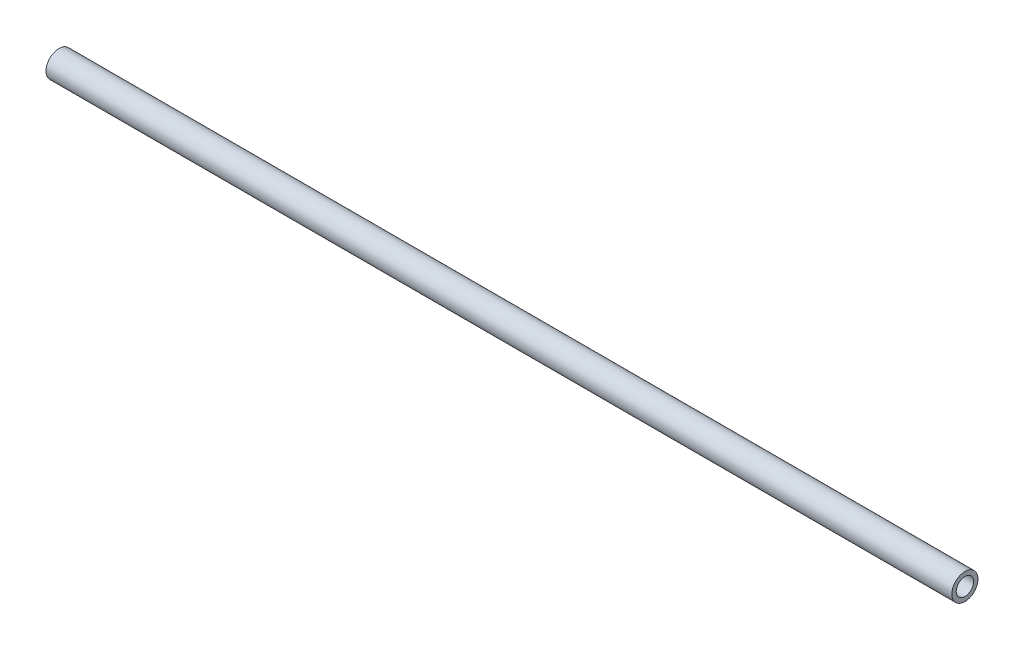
from build123d import *

# Parameters (mm, degrees)
SKETCH1_R           = 4.7625
SKETCH1_R_2         = 3.175
BOSS_EXTRUDE1_DEPTH = 330.2


with BuildPart() as part:
    # Sketch1 → Boss-Extrude1 (new body)
    with BuildSketch(Plane(origin=(0, 0, 0), x_dir=(0, 0, -1), z_dir=(1, 0, 0))):
        Circle(SKETCH1_R)
        Circle(SKETCH1_R_2, mode=Mode.SUBTRACT)
    extrude(amount=BOSS_EXTRUDE1_DEPTH)


solid = part.part
